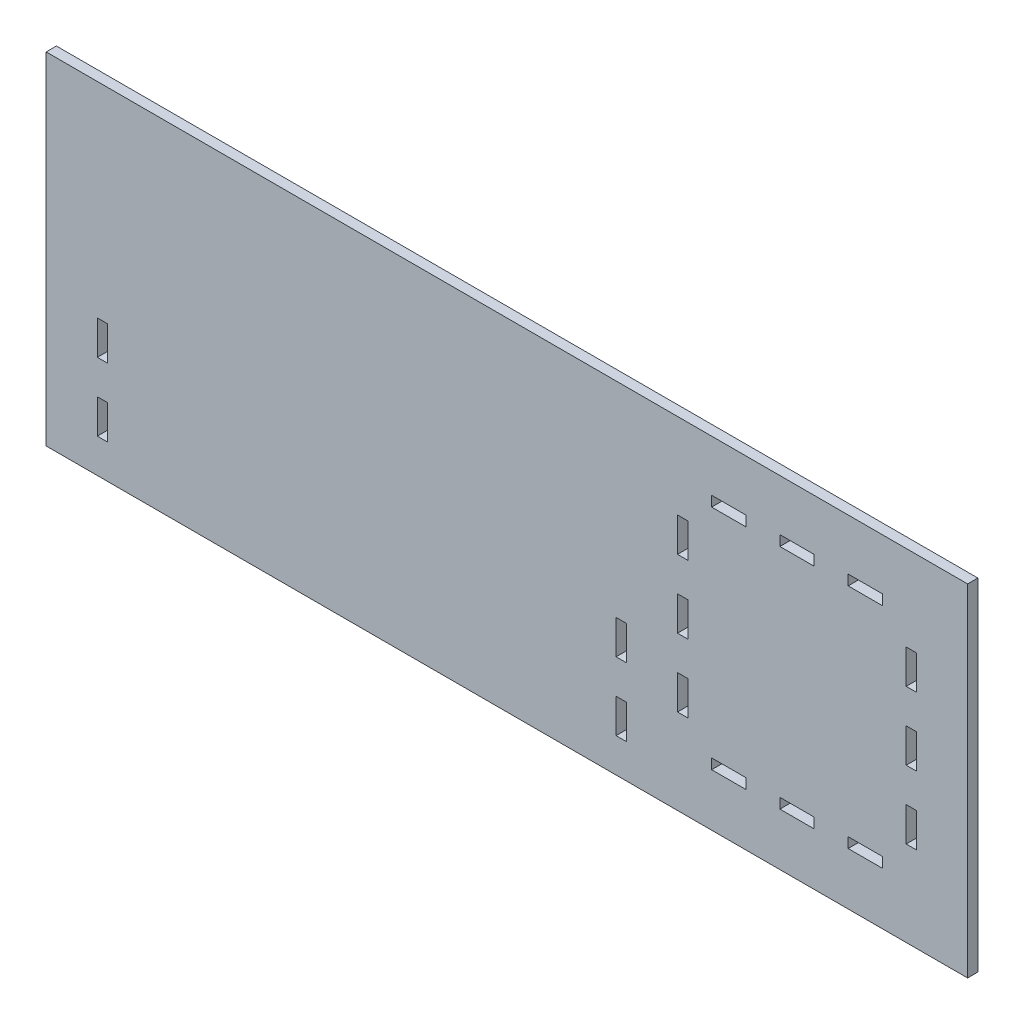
from build123d import *

# Parameters (mm, degrees)
SKETCH1_W           = 270
SKETCH1_H           = 100
BOSS_EXTRUDE2_DEPTH = 3
SKETCH3_W           = 3
SKETCH3_H           = 10
SKETCH3_W_2         = 10
SKETCH3_H_2         = 3
CUT_EXTRUDE3_DEPTH  = 3
SKETCH5_W           = 3
SKETCH5_H           = 10
CUT_EXTRUDE4_DEPTH  = 3
SKETCH6_W           = 3
SKETCH6_H           = 10
CUT_EXTRUDE5_DEPTH  = 3


with BuildPart() as part:
    # Sketch1 → Boss-Extrude2 (new body)
    with BuildSketch(Plane.XY):
        Rectangle(SKETCH1_W, SKETCH1_H)
    extrude(amount=BOSS_EXTRUDE2_DEPTH)

    # Sketch3 → Cut-Extrude3 (cut)
    with BuildSketch(Plane.XY.offset(3)):
        with Locations((118.5, 0)):
            Rectangle(SKETCH3_W, SKETCH3_H)
        with Locations((85, 33.5)):
            Rectangle(SKETCH3_W_2, SKETCH3_H_2)
        with Locations((51.5, 0)):
            Rectangle(SKETCH3_W, SKETCH3_H)
        with Locations((85, -33.146360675)):
            Rectangle(SKETCH3_W_2, SKETCH3_H_2)
        with Locations((65, 33.5)):
            Rectangle(SKETCH3_W_2, SKETCH3_H_2)
        with Locations((105, 33.5)):
            Rectangle(SKETCH3_W_2, SKETCH3_H_2)
        with Locations((51.5, 20)):
            Rectangle(SKETCH3_W, SKETCH3_H)
        with Locations((51.5, -20)):
            Rectangle(SKETCH3_W, SKETCH3_H)
        with Locations((65, -33.146360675)):
            Rectangle(SKETCH3_W_2, SKETCH3_H_2)
        with Locations((105, -33.146360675)):
            Rectangle(SKETCH3_W_2, SKETCH3_H_2)
        with Locations((118.5, -20)):
            Rectangle(SKETCH3_W, SKETCH3_H)
        with Locations((118.5, 20)):
            Rectangle(SKETCH3_W, SKETCH3_H)
    extrude(amount=-CUT_EXTRUDE3_DEPTH, mode=Mode.SUBTRACT)

    # Sketch5 → Cut-Extrude4 (cut)
    with BuildSketch(Plane.XY.offset(3)):
        with Locations((-118.5, -35)):
            Rectangle(SKETCH5_W, SKETCH5_H)
        with Locations((-118.5, -15)):
            Rectangle(SKETCH5_W, SKETCH5_H)
    extrude(amount=-CUT_EXTRUDE4_DEPTH, mode=Mode.SUBTRACT)

    # Sketch6 → Cut-Extrude5 (cut)
    with BuildSketch(Plane.XY.offset(3)):
        with Locations((33.5, -35)):
            Rectangle(SKETCH6_W, SKETCH6_H)
        with Locations((33.5, -15)):
            Rectangle(SKETCH6_W, SKETCH6_H)
    extrude(amount=-CUT_EXTRUDE5_DEPTH, mode=Mode.SUBTRACT)


solid = part.part
